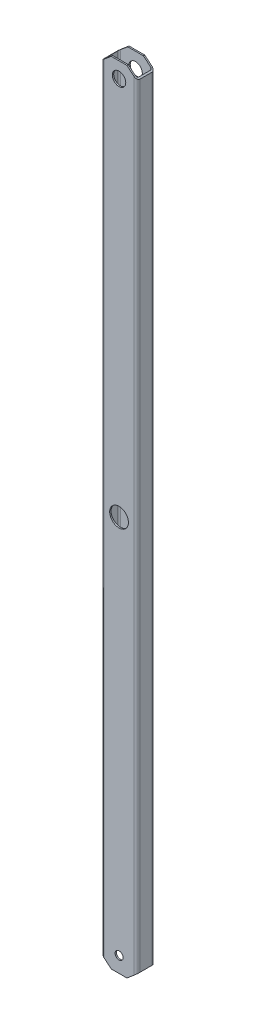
ISO-10303-21;
HEADER;
FILE_DESCRIPTION(('STEP AP214'),'2;1');
FILE_NAME('part.step','',(''),(''),'','','');
FILE_SCHEMA(('AUTOMOTIVE_DESIGN { 1 0 10303 214 1 1 1 1 }'));
ENDSEC;
DATA;
#1=APPLICATION_CONTEXT('core data for automotive mechanical design processes');
#2=APPLICATION_PROTOCOL_DEFINITION('international standard','automotive_design',2000,#1);
#3=PRODUCT_CONTEXT('',#1,'mechanical');
#4=PRODUCT('Part','Part','',(#3));
#5=PRODUCT_RELATED_PRODUCT_CATEGORY('part','',(#4));
#6=PRODUCT_DEFINITION_FORMATION('','',#4);
#7=PRODUCT_DEFINITION_CONTEXT('part definition',#1,'design');
#8=PRODUCT_DEFINITION('design','',#6,#7);
#9=PRODUCT_DEFINITION_SHAPE('','',#8);
#10=(LENGTH_UNIT() NAMED_UNIT(*) SI_UNIT(.MILLI.,.METRE.));
#11=(NAMED_UNIT(*) PLANE_ANGLE_UNIT() SI_UNIT($,.RADIAN.));
#12=(NAMED_UNIT(*) SI_UNIT($,.STERADIAN.) SOLID_ANGLE_UNIT());
#13=UNCERTAINTY_MEASURE_WITH_UNIT(LENGTH_MEASURE(1.E-05),#10,'distance_accuracy_value','');
#14=(GEOMETRIC_REPRESENTATION_CONTEXT(3) GLOBAL_UNCERTAINTY_ASSIGNED_CONTEXT((#13)) GLOBAL_UNIT_ASSIGNED_CONTEXT((#10,
#11,#12)) REPRESENTATION_CONTEXT('',''));
#15=CARTESIAN_POINT('',(0.,0.,0.));
#16=DIRECTION('',(0.,0.,1.));
#17=DIRECTION('',(1.,0.,0.));
#18=AXIS2_PLACEMENT_3D('',#15,#16,#17);
#19=CARTESIAN_POINT('',(33.6,-885.,-13.6000000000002));
#20=DIRECTION('',(0.,-1.,0.));
#21=DIRECTION('',(0.,0.,-1.));
#22=AXIS2_PLACEMENT_3D('',#19,#20,#21);
#23=PLANE('',#22);
#24=DIRECTION('',(0.,0.,-1.));
#25=VECTOR('',#24,1.);
#26=CARTESIAN_POINT('',(17.4999999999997,-885.,-13.6000000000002));
#27=LINE('',#26,#25);
#28=CARTESIAN_POINT('',(17.4999999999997,-885.,20.0000000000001));
#29=VERTEX_POINT('',#28);
#30=CARTESIAN_POINT('',(17.4999999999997,-885.,16.9999999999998));
#31=VERTEX_POINT('',#30);
#32=EDGE_CURVE('E12',#29,#31,#27,.T.);
#33=ORIENTED_EDGE('',*,*,#32,.F.);
#34=DIRECTION('',(-1.,0.,0.));
#35=VECTOR('',#34,1.);
#36=CARTESIAN_POINT('',(-33.6,-885.,19.9999999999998));
#37=LINE('',#36,#35);
#38=CARTESIAN_POINT('',(-17.5000000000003,-885.,20.0000000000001));
#39=VERTEX_POINT('',#38);
#40=EDGE_CURVE('E235',#29,#39,#37,.T.);
#41=ORIENTED_EDGE('',*,*,#40,.T.);
#42=DIRECTION('',(0.,0.,1.));
#43=VECTOR('',#42,1.);
#44=CARTESIAN_POINT('',(-17.5000000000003,-885.,-13.6000000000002));
#45=LINE('',#44,#43);
#46=CARTESIAN_POINT('',(-17.5000000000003,-885.,16.9999999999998));
#47=VERTEX_POINT('',#46);
#48=EDGE_CURVE('E71',#47,#39,#45,.T.);
#49=ORIENTED_EDGE('',*,*,#48,.F.);
#50=DIRECTION('',(-1.,0.,0.));
#51=VECTOR('',#50,1.);
#52=CARTESIAN_POINT('',(-33.6,-885.,16.9999999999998));
#53=LINE('',#52,#51);
#54=EDGE_CURVE('E244',#31,#47,#53,.T.);
#55=ORIENTED_EDGE('',*,*,#54,.F.);
#56=EDGE_LOOP('',(#33,#41,#49,#55));
#57=FACE_BOUND('',#56,.T.);
#58=ADVANCED_FACE('F63',(#57),#23,.T.);
#59=CARTESIAN_POINT('',(33.6,885.,-13.5999999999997));
#60=DIRECTION('',(0.,-1.,0.));
#61=DIRECTION('',(0.,0.,-1.));
#62=AXIS2_PLACEMENT_3D('',#59,#60,#61);
#63=PLANE('',#62);
#64=DIRECTION('',(-1.,0.,0.));
#65=VECTOR('',#64,1.);
#66=CARTESIAN_POINT('',(-33.6,885.,20.0000000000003));
#67=LINE('',#66,#65);
#68=CARTESIAN_POINT('',(17.5,885.,20.0000000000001));
#69=VERTEX_POINT('',#68);
#70=CARTESIAN_POINT('',(-17.5,885.,20.0000000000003));
#71=VERTEX_POINT('',#70);
#72=EDGE_CURVE('E260',#69,#71,#67,.T.);
#73=ORIENTED_EDGE('',*,*,#72,.F.);
#74=DIRECTION('',(0.,0.,-1.));
#75=VECTOR('',#74,1.);
#76=CARTESIAN_POINT('',(17.5,885.,-13.5999999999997));
#77=LINE('',#76,#75);
#78=CARTESIAN_POINT('',(17.5,885.,17.0000000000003));
#79=VERTEX_POINT('',#78);
#80=EDGE_CURVE('E228',#69,#79,#77,.T.);
#81=ORIENTED_EDGE('',*,*,#80,.T.);
#82=DIRECTION('',(-1.,0.,0.));
#83=VECTOR('',#82,1.);
#84=CARTESIAN_POINT('',(-33.6,885.,17.0000000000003));
#85=LINE('',#84,#83);
#86=CARTESIAN_POINT('',(-17.5,885.,17.0000000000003));
#87=VERTEX_POINT('',#86);
#88=EDGE_CURVE('E256',#79,#87,#85,.T.);
#89=ORIENTED_EDGE('',*,*,#88,.T.);
#90=DIRECTION('',(0.,0.,1.));
#91=VECTOR('',#90,1.);
#92=CARTESIAN_POINT('',(-17.5,885.,-13.5999999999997));
#93=LINE('',#92,#91);
#94=EDGE_CURVE('E288',#87,#71,#93,.T.);
#95=ORIENTED_EDGE('',*,*,#94,.T.);
#96=EDGE_LOOP('',(#73,#81,#89,#95));
#97=FACE_BOUND('',#96,.T.);
#98=ADVANCED_FACE('F317',(#97),#63,.F.);
#99=CARTESIAN_POINT('',(33.6,-885.,-13.6000000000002));
#100=DIRECTION('',(0.,1.,0.));
#101=DIRECTION('',(0.,0.,1.));
#102=AXIS2_PLACEMENT_3D('',#99,#100,#101);
#103=CYLINDRICAL_SURFACE('',#102,6.40000000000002);
#104=DIRECTION('',(0.,1.,0.));
#105=VECTOR('',#104,1.);
#106=CARTESIAN_POINT('',(33.6,-885.,-20.0000000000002));
#107=LINE('',#106,#105);
#108=CARTESIAN_POINT('',(33.6,-871.490495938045,-20.0000000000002));
#109=VERTEX_POINT('',#108);
#110=CARTESIAN_POINT('',(33.5999999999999,871.490495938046,-19.9999999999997));
#111=VERTEX_POINT('',#110);
#112=EDGE_CURVE('E266',#109,#111,#107,.T.);
#113=ORIENTED_EDGE('',*,*,#112,.T.);
#114=CARTESIAN_POINT('',(33.6,871.490495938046,-13.5999999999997));
#115=DIRECTION('',(-0.642787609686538,-0.766044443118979,0.));
#116=DIRECTION('',(-0.766044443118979,0.642787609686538,0.));
#117=AXIS2_PLACEMENT_3D('',#114,#115,#116);
#118=ELLIPSE('',#117,8.35460665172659,6.40000000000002);
#119=CARTESIAN_POINT('',(40.,866.120258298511,-13.6000000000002));
#120=VERTEX_POINT('',#119);
#121=EDGE_CURVE('E363',#111,#120,#118,.T.);
#122=ORIENTED_EDGE('',*,*,#121,.T.);
#123=DIRECTION('',(0.,1.,0.));
#124=VECTOR('',#123,1.);
#125=CARTESIAN_POINT('',(40.,-885.,-13.6000000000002));
#126=LINE('',#125,#124);
#127=CARTESIAN_POINT('',(39.9999999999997,-866.120258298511,-13.6000000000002));
#128=VERTEX_POINT('',#127);
#129=EDGE_CURVE('E285',#128,#120,#126,.T.);
#130=ORIENTED_EDGE('',*,*,#129,.F.);
#131=CARTESIAN_POINT('',(33.6,-871.490495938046,-13.6000000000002));
#132=DIRECTION('',(-0.642787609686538,0.766044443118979,0.));
#133=DIRECTION('',(0.766044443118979,0.642787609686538,0.));
#134=AXIS2_PLACEMENT_3D('',#131,#132,#133);
#135=ELLIPSE('',#134,8.35460665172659,6.40000000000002);
#136=EDGE_CURVE('E392',#128,#109,#135,.T.);
#137=ORIENTED_EDGE('',*,*,#136,.T.);
#138=EDGE_LOOP('',(#113,#122,#130,#137));
#139=FACE_BOUND('',#138,.T.);
#140=ADVANCED_FACE('F531',(#139),#103,.T.);
#141=CARTESIAN_POINT('',(40.,-885.,-13.6000000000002));
#142=DIRECTION('',(-1.,0.,0.));
#143=DIRECTION('',(0.,0.,1.));
#144=AXIS2_PLACEMENT_3D('',#141,#142,#143);
#145=PLANE('',#144);
#146=ORIENTED_EDGE('',*,*,#129,.T.);
#147=DIRECTION('',(0.,0.,1.));
#148=VECTOR('',#147,1.);
#149=CARTESIAN_POINT('',(40.,866.120258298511,-79.3969696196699));
#150=LINE('',#149,#148);
#151=CARTESIAN_POINT('',(40.,866.120258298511,13.6000000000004));
#152=VERTEX_POINT('',#151);
#153=EDGE_CURVE('E470',#120,#152,#150,.T.);
#154=ORIENTED_EDGE('',*,*,#153,.T.);
#155=DIRECTION('',(0.,1.,0.));
#156=VECTOR('',#155,1.);
#157=CARTESIAN_POINT('',(40.,-885.,13.5999999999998));
#158=LINE('',#157,#156);
#159=CARTESIAN_POINT('',(40.,-866.120258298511,13.5999999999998));
#160=VERTEX_POINT('',#159);
#161=EDGE_CURVE('E282',#160,#152,#158,.T.);
#162=ORIENTED_EDGE('',*,*,#161,.F.);
#163=DIRECTION('',(0.,0.,1.));
#164=VECTOR('',#163,1.);
#165=CARTESIAN_POINT('',(39.9999999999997,-866.120258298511,-79.3969696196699));
#166=LINE('',#165,#164);
#167=EDGE_CURVE('E428',#128,#160,#166,.T.);
#168=ORIENTED_EDGE('',*,*,#167,.F.);
#169=EDGE_LOOP('',(#146,#154,#162,#168));
#170=FACE_BOUND('',#169,.T.);
#171=ADVANCED_FACE('F775',(#170),#145,.F.);
#172=CARTESIAN_POINT('',(33.6,-885.,13.5999999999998));
#173=DIRECTION('',(0.,1.,0.));
#174=DIRECTION('',(0.,0.,1.));
#175=AXIS2_PLACEMENT_3D('',#172,#173,#174);
#176=CYLINDRICAL_SURFACE('',#175,6.40000000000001);
#177=ORIENTED_EDGE('',*,*,#161,.T.);
#178=CARTESIAN_POINT('',(33.6,871.490495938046,13.6000000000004));
#179=DIRECTION('',(-0.642787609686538,-0.766044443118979,0.));
#180=DIRECTION('',(-0.766044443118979,0.642787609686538,0.));
#181=AXIS2_PLACEMENT_3D('',#178,#179,#180);
#182=ELLIPSE('',#181,8.35460665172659,6.40000000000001);
#183=CARTESIAN_POINT('',(33.5999999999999,871.490495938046,20.0000000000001));
#184=VERTEX_POINT('',#183);
#185=EDGE_CURVE('E360',#152,#184,#182,.T.);
#186=ORIENTED_EDGE('',*,*,#185,.T.);
#187=DIRECTION('',(0.,1.,0.));
#188=VECTOR('',#187,1.);
#189=CARTESIAN_POINT('',(33.6,-885.,19.9999999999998));
#190=LINE('',#189,#188);
#191=CARTESIAN_POINT('',(33.6,-871.490495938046,20.0000000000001));
#192=VERTEX_POINT('',#191);
#193=EDGE_CURVE('E280',#192,#184,#190,.T.);
#194=ORIENTED_EDGE('',*,*,#193,.F.);
#195=CARTESIAN_POINT('',(33.6,-871.490495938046,13.5999999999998));
#196=DIRECTION('',(-0.642787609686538,0.766044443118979,0.));
#197=DIRECTION('',(0.766044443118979,0.642787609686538,0.));
#198=AXIS2_PLACEMENT_3D('',#195,#196,#197);
#199=ELLIPSE('',#198,8.35460665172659,6.40000000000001);
#200=EDGE_CURVE('E389',#192,#160,#199,.T.);
#201=ORIENTED_EDGE('',*,*,#200,.T.);
#202=EDGE_LOOP('',(#177,#186,#194,#201));
#203=FACE_BOUND('',#202,.T.);
#204=ADVANCED_FACE('F764',(#203),#176,.T.);
#205=CARTESIAN_POINT('',(-33.6,-885.,19.9999999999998));
#206=DIRECTION('',(0.,0.,-1.));
#207=DIRECTION('',(-1.,0.,0.));
#208=AXIS2_PLACEMENT_3D('',#205,#206,#207);
#209=PLANE('',#208);
#210=CARTESIAN_POINT('',(0.,850.,20.0000000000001));
#211=DIRECTION('',(0.,0.,1.));
#212=DIRECTION('',(1.,0.,0.));
#213=AXIS2_PLACEMENT_3D('',#210,#211,#212);
#214=CIRCLE('',#213,15.);
#215=CARTESIAN_POINT('',(15.,850.,20.0000000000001));
#216=VERTEX_POINT('',#215);
#217=EDGE_CURVE('E460',#216,#216,#214,.T.);
#218=ORIENTED_EDGE('',*,*,#217,.F.);
#219=EDGE_LOOP('',(#218));
#220=FACE_BOUND('',#219,.T.);
#221=CARTESIAN_POINT('',(0.,-850.,20.0000000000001));
#222=DIRECTION('',(0.,0.,1.));
#223=DIRECTION('',(1.,0.,0.));
#224=AXIS2_PLACEMENT_3D('',#221,#222,#223);
#225=CIRCLE('',#224,9.);
#226=CARTESIAN_POINT('',(9.,-850.,20.0000000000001));
#227=VERTEX_POINT('',#226);
#228=EDGE_CURVE('E430',#227,#227,#225,.T.);
#229=ORIENTED_EDGE('',*,*,#228,.F.);
#230=EDGE_LOOP('',(#229));
#231=FACE_BOUND('',#230,.T.);
#232=CARTESIAN_POINT('',(0.,0.,20.0000000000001));
#233=DIRECTION('',(0.,0.,1.));
#234=DIRECTION('',(1.,0.,0.));
#235=AXIS2_PLACEMENT_3D('',#232,#233,#234);
#236=CIRCLE('',#235,21.);
#237=CARTESIAN_POINT('',(21.,0.,20.0000000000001));
#238=VERTEX_POINT('',#237);
#239=EDGE_CURVE('E455',#238,#238,#236,.T.);
#240=ORIENTED_EDGE('',*,*,#239,.F.);
#241=EDGE_LOOP('',(#240));
#242=FACE_BOUND('',#241,.T.);
#243=ORIENTED_EDGE('',*,*,#193,.T.);
#244=DIRECTION('',(0.766044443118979,-0.642787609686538,0.));
#245=VECTOR('',#244,1.);
#246=CARTESIAN_POINT('',(40.,866.120258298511,20.0000000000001));
#247=LINE('',#246,#245);
#248=EDGE_CURVE('E468',#69,#184,#247,.T.);
#249=ORIENTED_EDGE('',*,*,#248,.F.);
#250=ORIENTED_EDGE('',*,*,#72,.T.);
#251=DIRECTION('',(0.766044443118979,0.642787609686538,0.));
#252=VECTOR('',#251,1.);
#253=CARTESIAN_POINT('',(-40.,866.120258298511,20.0000000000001));
#254=LINE('',#253,#252);
#255=CARTESIAN_POINT('',(-33.6,871.490495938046,20.0000000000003));
#256=VERTEX_POINT('',#255);
#257=EDGE_CURVE('E437',#256,#71,#254,.T.);
#258=ORIENTED_EDGE('',*,*,#257,.F.);
#259=DIRECTION('',(0.,1.,0.));
#260=VECTOR('',#259,1.);
#261=CARTESIAN_POINT('',(-33.6,-885.,19.9999999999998));
#262=LINE('',#261,#260);
#263=CARTESIAN_POINT('',(-33.6,-871.490495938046,20.));
#264=VERTEX_POINT('',#263);
#265=EDGE_CURVE('E238',#264,#256,#262,.T.);
#266=ORIENTED_EDGE('',*,*,#265,.F.);
#267=DIRECTION('',(-0.766044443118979,0.642787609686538,0.));
#268=VECTOR('',#267,1.);
#269=CARTESIAN_POINT('',(-40.0000000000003,-866.120258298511,20.0000000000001));
#270=LINE('',#269,#268);
#271=EDGE_CURVE('E222',#39,#264,#270,.T.);
#272=ORIENTED_EDGE('',*,*,#271,.F.);
#273=ORIENTED_EDGE('',*,*,#40,.F.);
#274=DIRECTION('',(-0.766044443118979,-0.642787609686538,0.));
#275=VECTOR('',#274,1.);
#276=CARTESIAN_POINT('',(39.9999999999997,-866.120258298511,20.0000000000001));
#277=LINE('',#276,#275);
#278=EDGE_CURVE('E432',#192,#29,#277,.T.);
#279=ORIENTED_EDGE('',*,*,#278,.F.);
#280=EDGE_LOOP('',(#243,#249,#250,#258,#266,#272,#273,#279));
#281=FACE_BOUND('',#280,.T.);
#282=ADVANCED_FACE('F233',(#220,#231,#242,#281),#209,.F.);
#283=CARTESIAN_POINT('',(-33.6,-885.,13.5999999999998));
#284=DIRECTION('',(0.,1.,0.));
#285=DIRECTION('',(0.,0.,1.));
#286=AXIS2_PLACEMENT_3D('',#283,#284,#285);
#287=CYLINDRICAL_SURFACE('',#286,6.40000000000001);
#288=DIRECTION('',(0.,1.,0.));
#289=VECTOR('',#288,1.);
#290=CARTESIAN_POINT('',(-40.,-885.,13.5999999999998));
#291=LINE('',#290,#289);
#292=CARTESIAN_POINT('',(-40.0000000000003,-866.120258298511,13.6000000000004));
#293=VERTEX_POINT('',#292);
#294=CARTESIAN_POINT('',(-40.,866.120258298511,13.6000000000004));
#295=VERTEX_POINT('',#294);
#296=EDGE_CURVE('E276',#293,#295,#291,.T.);
#297=ORIENTED_EDGE('',*,*,#296,.F.);
#298=CARTESIAN_POINT('',(-33.6,-871.490495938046,13.5999999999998));
#299=DIRECTION('',(0.642787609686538,0.766044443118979,0.));
#300=DIRECTION('',(-0.766044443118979,0.642787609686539,0.));
#301=AXIS2_PLACEMENT_3D('',#298,#299,#300);
#302=ELLIPSE('',#301,8.35460665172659,6.40000000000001);
#303=EDGE_CURVE('E378',#293,#264,#302,.T.);
#304=ORIENTED_EDGE('',*,*,#303,.T.);
#305=ORIENTED_EDGE('',*,*,#265,.T.);
#306=CARTESIAN_POINT('',(-33.6,871.490495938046,13.6000000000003));
#307=DIRECTION('',(0.642787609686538,-0.766044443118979,0.));
#308=DIRECTION('',(0.766044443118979,0.642787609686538,0.));
#309=AXIS2_PLACEMENT_3D('',#306,#307,#308);
#310=ELLIPSE('',#309,8.35460665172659,6.40000000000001);
#311=EDGE_CURVE('E348',#256,#295,#310,.T.);
#312=ORIENTED_EDGE('',*,*,#311,.T.);
#313=EDGE_LOOP('',(#297,#304,#305,#312));
#314=FACE_BOUND('',#313,.T.);
#315=ADVANCED_FACE('F448',(#314),#287,.T.);
#316=CARTESIAN_POINT('',(-40.,-885.,13.5999999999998));
#317=DIRECTION('',(1.,0.,0.));
#318=DIRECTION('',(0.,0.,-1.));
#319=AXIS2_PLACEMENT_3D('',#316,#317,#318);
#320=PLANE('',#319);
#321=DIRECTION('',(0.,1.,0.));
#322=VECTOR('',#321,1.);
#323=CARTESIAN_POINT('',(-40.,-885.,-13.6000000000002));
#324=LINE('',#323,#322);
#325=CARTESIAN_POINT('',(-40.0000000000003,-866.120258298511,-13.6000000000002));
#326=VERTEX_POINT('',#325);
#327=CARTESIAN_POINT('',(-40.,866.120258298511,-13.5999999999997));
#328=VERTEX_POINT('',#327);
#329=EDGE_CURVE('E273',#326,#328,#324,.T.);
#330=ORIENTED_EDGE('',*,*,#329,.F.);
#331=DIRECTION('',(0.,0.,1.));
#332=VECTOR('',#331,1.);
#333=CARTESIAN_POINT('',(-40.0000000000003,-866.120258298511,-79.3969696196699));
#334=LINE('',#333,#332);
#335=EDGE_CURVE('E239',#326,#293,#334,.T.);
#336=ORIENTED_EDGE('',*,*,#335,.T.);
#337=ORIENTED_EDGE('',*,*,#296,.T.);
#338=DIRECTION('',(0.,0.,1.));
#339=VECTOR('',#338,1.);
#340=CARTESIAN_POINT('',(-40.,866.120258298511,-79.3969696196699));
#341=LINE('',#340,#339);
#342=EDGE_CURVE('E439',#328,#295,#341,.T.);
#343=ORIENTED_EDGE('',*,*,#342,.F.);
#344=EDGE_LOOP('',(#330,#336,#337,#343));
#345=FACE_BOUND('',#344,.T.);
#346=ADVANCED_FACE('F450',(#345),#320,.F.);
#347=CARTESIAN_POINT('',(-33.6,-885.,-13.6000000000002));
#348=DIRECTION('',(0.,1.,0.));
#349=DIRECTION('',(0.,0.,1.));
#350=AXIS2_PLACEMENT_3D('',#347,#348,#349);
#351=CYLINDRICAL_SURFACE('',#350,6.40000000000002);
#352=DIRECTION('',(0.,1.,0.));
#353=VECTOR('',#352,1.);
#354=CARTESIAN_POINT('',(-33.6,-885.,-20.0000000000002));
#355=LINE('',#354,#353);
#356=CARTESIAN_POINT('',(-33.6,-871.490495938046,-20.0000000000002));
#357=VERTEX_POINT('',#356);
#358=CARTESIAN_POINT('',(-33.5999999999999,871.490495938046,-19.9999999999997));
#359=VERTEX_POINT('',#358);
#360=EDGE_CURVE('E269',#357,#359,#355,.T.);
#361=ORIENTED_EDGE('',*,*,#360,.F.);
#362=CARTESIAN_POINT('',(-33.6,-871.490495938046,-13.6000000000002));
#363=DIRECTION('',(0.642787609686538,0.766044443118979,0.));
#364=DIRECTION('',(-0.766044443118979,0.642787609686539,0.));
#365=AXIS2_PLACEMENT_3D('',#362,#363,#364);
#366=ELLIPSE('',#365,8.3546066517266,6.40000000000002);
#367=EDGE_CURVE('E375',#357,#326,#366,.T.);
#368=ORIENTED_EDGE('',*,*,#367,.T.);
#369=ORIENTED_EDGE('',*,*,#329,.T.);
#370=CARTESIAN_POINT('',(-33.6,871.490495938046,-13.5999999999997));
#371=DIRECTION('',(0.642787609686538,-0.766044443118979,0.));
#372=DIRECTION('',(0.766044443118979,0.642787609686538,0.));
#373=AXIS2_PLACEMENT_3D('',#370,#371,#372);
#374=ELLIPSE('',#373,8.35460665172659,6.40000000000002);
#375=EDGE_CURVE('E345',#328,#359,#374,.T.);
#376=ORIENTED_EDGE('',*,*,#375,.T.);
#377=EDGE_LOOP('',(#361,#368,#369,#376));
#378=FACE_BOUND('',#377,.T.);
#379=ADVANCED_FACE('F518',(#378),#351,.T.);
#380=CARTESIAN_POINT('',(33.6,-885.,13.5999999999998));
#381=DIRECTION('',(0.,1.,0.));
#382=DIRECTION('',(0.,0.,1.));
#383=AXIS2_PLACEMENT_3D('',#380,#381,#382);
#384=CYLINDRICAL_SURFACE('',#383,3.4);
#385=CARTESIAN_POINT('',(33.6,871.490495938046,13.6000000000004));
#386=DIRECTION('',(-0.642787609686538,-0.766044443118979,0.));
#387=DIRECTION('',(-0.766044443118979,0.642787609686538,0.));
#388=AXIS2_PLACEMENT_3D('',#385,#386,#387);
#389=ELLIPSE('',#388,4.43838478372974,3.4);
#390=CARTESIAN_POINT('',(37.,868.637557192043,13.6000000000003));
#391=VERTEX_POINT('',#390);
#392=CARTESIAN_POINT('',(33.6,871.490495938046,17.0000000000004));
#393=VERTEX_POINT('',#392);
#394=EDGE_CURVE('E352',#391,#393,#389,.T.);
#395=ORIENTED_EDGE('',*,*,#394,.F.);
#396=DIRECTION('',(0.,1.,0.));
#397=VECTOR('',#396,1.);
#398=CARTESIAN_POINT('',(37.,-885.,13.5999999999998));
#399=LINE('',#398,#397);
#400=CARTESIAN_POINT('',(37.,-868.637557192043,13.5999999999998));
#401=VERTEX_POINT('',#400);
#402=EDGE_CURVE('E270',#401,#391,#399,.T.);
#403=ORIENTED_EDGE('',*,*,#402,.F.);
#404=CARTESIAN_POINT('',(33.6,-871.490495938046,13.5999999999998));
#405=DIRECTION('',(-0.642787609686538,0.766044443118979,0.));
#406=DIRECTION('',(0.766044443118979,0.642787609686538,0.));
#407=AXIS2_PLACEMENT_3D('',#404,#405,#406);
#408=ELLIPSE('',#407,4.43838478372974,3.4);
#409=CARTESIAN_POINT('',(33.6,-871.490495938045,16.9999999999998));
#410=VERTEX_POINT('',#409);
#411=EDGE_CURVE('E382',#410,#401,#408,.T.);
#412=ORIENTED_EDGE('',*,*,#411,.F.);
#413=DIRECTION('',(0.,1.,0.));
#414=VECTOR('',#413,1.);
#415=CARTESIAN_POINT('',(33.6,-885.,16.9999999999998));
#416=LINE('',#415,#414);
#417=EDGE_CURVE('E247',#410,#393,#416,.T.);
#418=ORIENTED_EDGE('',*,*,#417,.T.);
#419=EDGE_LOOP('',(#395,#403,#412,#418));
#420=FACE_BOUND('',#419,.T.);
#421=ADVANCED_FACE('F65',(#420),#384,.F.);
#422=CARTESIAN_POINT('',(37.,-885.,-13.6000000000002));
#423=DIRECTION('',(-1.,0.,0.));
#424=DIRECTION('',(0.,0.,1.));
#425=AXIS2_PLACEMENT_3D('',#422,#423,#424);
#426=PLANE('',#425);
#427=DIRECTION('',(0.,0.,1.));
#428=VECTOR('',#427,1.);
#429=CARTESIAN_POINT('',(37.,868.637557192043,-13.6000000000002));
#430=LINE('',#429,#428);
#431=CARTESIAN_POINT('',(37.,868.637557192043,-13.6000000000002));
#432=VERTEX_POINT('',#431);
#433=EDGE_CURVE('E354',#432,#391,#430,.T.);
#434=ORIENTED_EDGE('',*,*,#433,.F.);
#435=DIRECTION('',(0.,1.,0.));
#436=VECTOR('',#435,1.);
#437=CARTESIAN_POINT('',(37.,-885.,-13.6000000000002));
#438=LINE('',#437,#436);
#439=CARTESIAN_POINT('',(37.,-868.637557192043,-13.6000000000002));
#440=VERTEX_POINT('',#439);
#441=EDGE_CURVE('E306',#440,#432,#438,.T.);
#442=ORIENTED_EDGE('',*,*,#441,.F.);
#443=DIRECTION('',(0.,0.,-1.));
#444=VECTOR('',#443,1.);
#445=CARTESIAN_POINT('',(37.,-868.637557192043,-13.6000000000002));
#446=LINE('',#445,#444);
#447=EDGE_CURVE('E384',#401,#440,#446,.T.);
#448=ORIENTED_EDGE('',*,*,#447,.F.);
#449=ORIENTED_EDGE('',*,*,#402,.T.);
#450=EDGE_LOOP('',(#434,#442,#448,#449));
#451=FACE_BOUND('',#450,.T.);
#452=ADVANCED_FACE('F506',(#451),#426,.T.);
#453=CARTESIAN_POINT('',(33.6,-885.,-13.6000000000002));
#454=DIRECTION('',(0.,1.,0.));
#455=DIRECTION('',(0.,0.,1.));
#456=AXIS2_PLACEMENT_3D('',#453,#454,#455);
#457=CYLINDRICAL_SURFACE('',#456,3.4);
#458=CARTESIAN_POINT('',(33.6,871.490495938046,-13.5999999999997));
#459=DIRECTION('',(-0.642787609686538,-0.766044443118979,0.));
#460=DIRECTION('',(-0.766044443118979,0.642787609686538,0.));
#461=AXIS2_PLACEMENT_3D('',#458,#459,#460);
#462=ELLIPSE('',#461,4.43838478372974,3.4);
#463=CARTESIAN_POINT('',(33.6,871.490495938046,-16.9999999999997));
#464=VERTEX_POINT('',#463);
#465=EDGE_CURVE('E356',#464,#432,#462,.T.);
#466=ORIENTED_EDGE('',*,*,#465,.F.);
#467=DIRECTION('',(0.,1.,0.));
#468=VECTOR('',#467,1.);
#469=CARTESIAN_POINT('',(33.6,-885.,-17.0000000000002));
#470=LINE('',#469,#468);
#471=CARTESIAN_POINT('',(33.6,-871.490495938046,-17.0000000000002));
#472=VERTEX_POINT('',#471);
#473=EDGE_CURVE('E303',#472,#464,#470,.T.);
#474=ORIENTED_EDGE('',*,*,#473,.F.);
#475=CARTESIAN_POINT('',(33.6,-871.490495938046,-13.6000000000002));
#476=DIRECTION('',(-0.642787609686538,0.766044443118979,0.));
#477=DIRECTION('',(0.766044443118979,0.642787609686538,0.));
#478=AXIS2_PLACEMENT_3D('',#475,#476,#477);
#479=ELLIPSE('',#478,4.43838478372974,3.4);
#480=EDGE_CURVE('E386',#440,#472,#479,.T.);
#481=ORIENTED_EDGE('',*,*,#480,.F.);
#482=ORIENTED_EDGE('',*,*,#441,.T.);
#483=EDGE_LOOP('',(#466,#474,#481,#482));
#484=FACE_BOUND('',#483,.T.);
#485=ADVANCED_FACE('F501',(#484),#457,.F.);
#486=CARTESIAN_POINT('',(33.6,-885.,-17.0000000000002));
#487=DIRECTION('',(0.,0.,1.));
#488=DIRECTION('',(0.,-1.,0.));
#489=AXIS2_PLACEMENT_3D('',#486,#487,#488);
#490=PLANE('',#489);
#491=CARTESIAN_POINT('',(0.,850.,-16.9999999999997));
#492=DIRECTION('',(0.,0.,1.));
#493=DIRECTION('',(0.,-1.,0.));
#494=AXIS2_PLACEMENT_3D('',#491,#492,#493);
#495=CIRCLE('',#494,15.);
#496=CARTESIAN_POINT('',(0.,835.,-16.9999999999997));
#497=VERTEX_POINT('',#496);
#498=EDGE_CURVE('E257',#497,#497,#495,.T.);
#499=ORIENTED_EDGE('',*,*,#498,.F.);
#500=EDGE_LOOP('',(#499));
#501=FACE_BOUND('',#500,.T.);
#502=DIRECTION('',(0.766044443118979,-0.642787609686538,0.));
#503=VECTOR('',#502,1.);
#504=CARTESIAN_POINT('',(898.502729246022,145.750934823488,-16.9999999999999));
#505=LINE('',#504,#503);
#506=CARTESIAN_POINT('',(17.5,885.,-16.9999999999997));
#507=VERTEX_POINT('',#506);
#508=EDGE_CURVE('E358',#507,#464,#505,.T.);
#509=ORIENTED_EDGE('',*,*,#508,.F.);
#510=DIRECTION('',(1.,0.,0.));
#511=VECTOR('',#510,1.);
#512=CARTESIAN_POINT('',(33.6,885.,-16.9999999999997));
#513=LINE('',#512,#511);
#514=CARTESIAN_POINT('',(-17.5,885.,-16.9999999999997));
#515=VERTEX_POINT('',#514);
#516=EDGE_CURVE('E253',#515,#507,#513,.T.);
#517=ORIENTED_EDGE('',*,*,#516,.F.);
#518=DIRECTION('',(0.766044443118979,0.642787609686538,0.));
#519=VECTOR('',#518,1.);
#520=CARTESIAN_POINT('',(-859.068150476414,178.840475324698,-16.9999999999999));
#521=LINE('',#520,#519);
#522=CARTESIAN_POINT('',(-33.6,871.490495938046,-16.9999999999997));
#523=VERTEX_POINT('',#522);
#524=EDGE_CURVE('E343',#523,#515,#521,.T.);
#525=ORIENTED_EDGE('',*,*,#524,.F.);
#526=DIRECTION('',(0.,1.,0.));
#527=VECTOR('',#526,1.);
#528=CARTESIAN_POINT('',(-33.6,-885.,-17.0000000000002));
#529=LINE('',#528,#527);
#530=CARTESIAN_POINT('',(-33.6,-871.490495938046,-17.0000000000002));
#531=VERTEX_POINT('',#530);
#532=EDGE_CURVE('E300',#531,#523,#529,.T.);
#533=ORIENTED_EDGE('',*,*,#532,.F.);
#534=DIRECTION('',(-0.766044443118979,0.642787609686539,0.));
#535=VECTOR('',#534,1.);
#536=CARTESIAN_POINT('',(12.48671093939,-910.161838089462,-17.0000000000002));
#537=LINE('',#536,#535);
#538=CARTESIAN_POINT('',(-17.5000000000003,-885.,-17.0000000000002));
#539=VERTEX_POINT('',#538);
#540=EDGE_CURVE('E373',#539,#531,#537,.T.);
#541=ORIENTED_EDGE('',*,*,#540,.F.);
#542=DIRECTION('',(1.,0.,0.));
#543=VECTOR('',#542,1.);
#544=CARTESIAN_POINT('',(33.6,-885.,-17.0000000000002));
#545=LINE('',#544,#543);
#546=CARTESIAN_POINT('',(17.4999999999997,-885.,-17.0000000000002));
#547=VERTEX_POINT('',#546);
#548=EDGE_CURVE('E249',#539,#547,#545,.T.);
#549=ORIENTED_EDGE('',*,*,#548,.T.);
#550=DIRECTION('',(-0.766044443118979,-0.642787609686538,0.));
#551=VECTOR('',#550,1.);
#552=CARTESIAN_POINT('',(26.9478678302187,-877.072297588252,-17.0000000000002));
#553=LINE('',#552,#551);
#554=EDGE_CURVE('E86',#472,#547,#553,.T.);
#555=ORIENTED_EDGE('',*,*,#554,.F.);
#556=ORIENTED_EDGE('',*,*,#473,.T.);
#557=EDGE_LOOP('',(#509,#517,#525,#533,#541,#549,#555,#556));
#558=FACE_BOUND('',#557,.T.);
#559=CARTESIAN_POINT('',(0.,-850.,-17.0000000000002));
#560=DIRECTION('',(0.,0.,1.));
#561=DIRECTION('',(0.,-1.,0.));
#562=AXIS2_PLACEMENT_3D('',#559,#560,#561);
#563=CIRCLE('',#562,9.);
#564=CARTESIAN_POINT('',(0.,-859.,-17.0000000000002));
#565=VERTEX_POINT('',#564);
#566=EDGE_CURVE('E404',#565,#565,#563,.T.);
#567=ORIENTED_EDGE('',*,*,#566,.F.);
#568=EDGE_LOOP('',(#567));
#569=FACE_BOUND('',#568,.T.);
#570=CARTESIAN_POINT('',(0.,0.,-16.9999999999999));
#571=DIRECTION('',(0.,0.,1.));
#572=DIRECTION('',(0.,-1.,0.));
#573=AXIS2_PLACEMENT_3D('',#570,#571,#572);
#574=CIRCLE('',#573,21.);
#575=CARTESIAN_POINT('',(0.,-21.,-17.));
#576=VERTEX_POINT('',#575);
#577=EDGE_CURVE('E398',#576,#576,#574,.T.);
#578=ORIENTED_EDGE('',*,*,#577,.F.);
#579=EDGE_LOOP('',(#578));
#580=FACE_BOUND('',#579,.T.);
#581=ADVANCED_FACE('F416',(#501,#558,#569,#580),#490,.T.);
#582=CARTESIAN_POINT('',(-33.6,-885.,-13.6000000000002));
#583=DIRECTION('',(0.,1.,0.));
#584=DIRECTION('',(0.,0.,1.));
#585=AXIS2_PLACEMENT_3D('',#582,#583,#584);
#586=CYLINDRICAL_SURFACE('',#585,3.4);
#587=CARTESIAN_POINT('',(-33.6,-871.490495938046,-13.6000000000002));
#588=DIRECTION('',(0.642787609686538,0.766044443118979,0.));
#589=DIRECTION('',(-0.766044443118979,0.642787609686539,0.));
#590=AXIS2_PLACEMENT_3D('',#587,#588,#589);
#591=ELLIPSE('',#590,4.43838478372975,3.4);
#592=CARTESIAN_POINT('',(-37.,-868.637557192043,-13.6000000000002));
#593=VERTEX_POINT('',#592);
#594=EDGE_CURVE('E371',#531,#593,#591,.T.);
#595=ORIENTED_EDGE('',*,*,#594,.F.);
#596=ORIENTED_EDGE('',*,*,#532,.T.);
#597=CARTESIAN_POINT('',(-33.6,871.490495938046,-13.5999999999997));
#598=DIRECTION('',(0.642787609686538,-0.766044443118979,0.));
#599=DIRECTION('',(0.766044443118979,0.642787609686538,0.));
#600=AXIS2_PLACEMENT_3D('',#597,#598,#599);
#601=ELLIPSE('',#600,4.43838478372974,3.4);
#602=CARTESIAN_POINT('',(-37.,868.637557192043,-13.6000000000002));
#603=VERTEX_POINT('',#602);
#604=EDGE_CURVE('E341',#603,#523,#601,.T.);
#605=ORIENTED_EDGE('',*,*,#604,.F.);
#606=DIRECTION('',(0.,1.,0.));
#607=VECTOR('',#606,1.);
#608=CARTESIAN_POINT('',(-37.,-885.,-13.6000000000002));
#609=LINE('',#608,#607);
#610=EDGE_CURVE('E297',#593,#603,#609,.T.);
#611=ORIENTED_EDGE('',*,*,#610,.F.);
#612=EDGE_LOOP('',(#595,#596,#605,#611));
#613=FACE_BOUND('',#612,.T.);
#614=ADVANCED_FACE('F689',(#613),#586,.F.);
#615=CARTESIAN_POINT('',(-37.,-885.,13.5999999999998));
#616=DIRECTION('',(1.,0.,0.));
#617=DIRECTION('',(0.,0.,-1.));
#618=AXIS2_PLACEMENT_3D('',#615,#616,#617);
#619=PLANE('',#618);
#620=DIRECTION('',(0.,0.,1.));
#621=VECTOR('',#620,1.);
#622=CARTESIAN_POINT('',(-37.,-868.637557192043,13.5999999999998));
#623=LINE('',#622,#621);
#624=CARTESIAN_POINT('',(-37.,-868.637557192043,13.5999999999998));
#625=VERTEX_POINT('',#624);
#626=EDGE_CURVE('E369',#593,#625,#623,.T.);
#627=ORIENTED_EDGE('',*,*,#626,.F.);
#628=ORIENTED_EDGE('',*,*,#610,.T.);
#629=DIRECTION('',(0.,0.,-1.));
#630=VECTOR('',#629,1.);
#631=CARTESIAN_POINT('',(-37.,868.637557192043,13.5999999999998));
#632=LINE('',#631,#630);
#633=CARTESIAN_POINT('',(-37.,868.637557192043,13.6000000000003));
#634=VERTEX_POINT('',#633);
#635=EDGE_CURVE('E334',#634,#603,#632,.T.);
#636=ORIENTED_EDGE('',*,*,#635,.F.);
#637=DIRECTION('',(0.,1.,0.));
#638=VECTOR('',#637,1.);
#639=CARTESIAN_POINT('',(-37.,-885.,13.5999999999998));
#640=LINE('',#639,#638);
#641=EDGE_CURVE('E294',#625,#634,#640,.T.);
#642=ORIENTED_EDGE('',*,*,#641,.F.);
#643=EDGE_LOOP('',(#627,#628,#636,#642));
#644=FACE_BOUND('',#643,.T.);
#645=ADVANCED_FACE('F678',(#644),#619,.T.);
#646=CARTESIAN_POINT('',(-33.6,-885.,13.5999999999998));
#647=DIRECTION('',(0.,1.,0.));
#648=DIRECTION('',(0.,0.,1.));
#649=AXIS2_PLACEMENT_3D('',#646,#647,#648);
#650=CYLINDRICAL_SURFACE('',#649,3.4);
#651=CARTESIAN_POINT('',(-33.6,-871.490495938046,13.5999999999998));
#652=DIRECTION('',(0.642787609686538,0.766044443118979,0.));
#653=DIRECTION('',(-0.766044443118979,0.642787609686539,0.));
#654=AXIS2_PLACEMENT_3D('',#651,#652,#653);
#655=ELLIPSE('',#654,4.43838478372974,3.4);
#656=CARTESIAN_POINT('',(-33.6,-871.490495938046,16.9999999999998));
#657=VERTEX_POINT('',#656);
#658=EDGE_CURVE('E367',#625,#657,#655,.T.);
#659=ORIENTED_EDGE('',*,*,#658,.F.);
#660=ORIENTED_EDGE('',*,*,#641,.T.);
#661=CARTESIAN_POINT('',(-33.6,871.490495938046,13.6000000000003));
#662=DIRECTION('',(0.642787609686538,-0.766044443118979,0.));
#663=DIRECTION('',(0.766044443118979,0.642787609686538,0.));
#664=AXIS2_PLACEMENT_3D('',#661,#662,#663);
#665=ELLIPSE('',#664,4.43838478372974,3.4);
#666=CARTESIAN_POINT('',(-33.6,871.490495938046,17.0000000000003));
#667=VERTEX_POINT('',#666);
#668=EDGE_CURVE('E331',#667,#634,#665,.T.);
#669=ORIENTED_EDGE('',*,*,#668,.F.);
#670=DIRECTION('',(0.,1.,0.));
#671=VECTOR('',#670,1.);
#672=CARTESIAN_POINT('',(-33.6,-885.,16.9999999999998));
#673=LINE('',#672,#671);
#674=EDGE_CURVE('E291',#657,#667,#673,.T.);
#675=ORIENTED_EDGE('',*,*,#674,.F.);
#676=EDGE_LOOP('',(#659,#660,#669,#675));
#677=FACE_BOUND('',#676,.T.);
#678=ADVANCED_FACE('F666',(#677),#650,.F.);
#679=CARTESIAN_POINT('',(-33.6,-885.,16.9999999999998));
#680=DIRECTION('',(0.,0.,-1.));
#681=DIRECTION('',(-1.,0.,0.));
#682=AXIS2_PLACEMENT_3D('',#679,#680,#681);
#683=PLANE('',#682);
#684=CARTESIAN_POINT('',(0.,850.,17.0000000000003));
#685=DIRECTION('',(0.,0.,-1.));
#686=DIRECTION('',(-1.,0.,0.));
#687=AXIS2_PLACEMENT_3D('',#684,#685,#686);
#688=CIRCLE('',#687,15.);
#689=CARTESIAN_POINT('',(-15.,850.,17.0000000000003));
#690=VERTEX_POINT('',#689);
#691=EDGE_CURVE('E407',#690,#690,#688,.T.);
#692=ORIENTED_EDGE('',*,*,#691,.F.);
#693=EDGE_LOOP('',(#692));
#694=FACE_BOUND('',#693,.T.);
#695=DIRECTION('',(-0.766044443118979,0.642787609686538,0.));
#696=VECTOR('',#695,1.);
#697=CARTESIAN_POINT('',(859.068150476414,178.840475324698,17.0000000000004));
#698=LINE('',#697,#696);
#699=EDGE_CURVE('E326',#393,#79,#698,.T.);
#700=ORIENTED_EDGE('',*,*,#699,.F.);
#701=ORIENTED_EDGE('',*,*,#417,.F.);
#702=DIRECTION('',(0.766044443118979,0.642787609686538,0.));
#703=VECTOR('',#702,1.);
#704=CARTESIAN_POINT('',(-12.4867109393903,-910.161838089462,16.9999999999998));
#705=LINE('',#704,#703);
#706=EDGE_CURVE('E380',#31,#410,#705,.T.);
#707=ORIENTED_EDGE('',*,*,#706,.F.);
#708=ORIENTED_EDGE('',*,*,#54,.T.);
#709=DIRECTION('',(0.766044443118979,-0.642787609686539,0.));
#710=VECTOR('',#709,1.);
#711=CARTESIAN_POINT('',(-26.9478678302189,-877.072297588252,16.9999999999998));
#712=LINE('',#711,#710);
#713=EDGE_CURVE('E78',#657,#47,#712,.T.);
#714=ORIENTED_EDGE('',*,*,#713,.F.);
#715=ORIENTED_EDGE('',*,*,#674,.T.);
#716=DIRECTION('',(-0.766044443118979,-0.642787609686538,0.));
#717=VECTOR('',#716,1.);
#718=CARTESIAN_POINT('',(-898.502729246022,145.750934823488,16.9999999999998));
#719=LINE('',#718,#717);
#720=EDGE_CURVE('E327',#87,#667,#719,.T.);
#721=ORIENTED_EDGE('',*,*,#720,.F.);
#722=ORIENTED_EDGE('',*,*,#88,.F.);
#723=EDGE_LOOP('',(#700,#701,#707,#708,#714,#715,#721,#722));
#724=FACE_BOUND('',#723,.T.);
#725=CARTESIAN_POINT('',(0.,-850.,16.9999999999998));
#726=DIRECTION('',(0.,0.,-1.));
#727=DIRECTION('',(-1.,0.,0.));
#728=AXIS2_PLACEMENT_3D('',#725,#726,#727);
#729=CIRCLE('',#728,9.);
#730=CARTESIAN_POINT('',(-9.,-850.,16.9999999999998));
#731=VERTEX_POINT('',#730);
#732=EDGE_CURVE('E401',#731,#731,#729,.T.);
#733=ORIENTED_EDGE('',*,*,#732,.F.);
#734=EDGE_LOOP('',(#733));
#735=FACE_BOUND('',#734,.T.);
#736=CARTESIAN_POINT('',(0.,0.,17.0000000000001));
#737=DIRECTION('',(0.,0.,-1.));
#738=DIRECTION('',(-1.,0.,0.));
#739=AXIS2_PLACEMENT_3D('',#736,#737,#738);
#740=CIRCLE('',#739,21.);
#741=CARTESIAN_POINT('',(-21.,0.,17.0000000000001));
#742=VERTEX_POINT('',#741);
#743=EDGE_CURVE('E395',#742,#742,#740,.T.);
#744=ORIENTED_EDGE('',*,*,#743,.F.);
#745=EDGE_LOOP('',(#744));
#746=FACE_BOUND('',#745,.T.);
#747=ADVANCED_FACE('F323',(#694,#724,#735,#746),#683,.T.);
#748=CARTESIAN_POINT('',(33.6,-885.,-20.0000000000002));
#749=DIRECTION('',(0.,0.,1.));
#750=DIRECTION('',(0.,-1.,0.));
#751=AXIS2_PLACEMENT_3D('',#748,#749,#750);
#752=PLANE('',#751);
#753=CARTESIAN_POINT('',(0.,850.,-19.9999999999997));
#754=DIRECTION('',(0.,0.,1.));
#755=DIRECTION('',(0.,-1.,0.));
#756=AXIS2_PLACEMENT_3D('',#753,#754,#755);
#757=CIRCLE('',#756,15.);
#758=CARTESIAN_POINT('',(0.,835.,-19.9999999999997));
#759=VERTEX_POINT('',#758);
#760=EDGE_CURVE('E440',#759,#759,#757,.F.);
#761=ORIENTED_EDGE('',*,*,#760,.F.);
#762=EDGE_LOOP('',(#761));
#763=FACE_BOUND('',#762,.T.);
#764=CARTESIAN_POINT('',(0.,-850.,-20.0000000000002));
#765=DIRECTION('',(0.,0.,1.));
#766=DIRECTION('',(0.,-1.,0.));
#767=AXIS2_PLACEMENT_3D('',#764,#765,#766);
#768=CIRCLE('',#767,9.);
#769=CARTESIAN_POINT('',(0.,-859.,-20.0000000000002));
#770=VERTEX_POINT('',#769);
#771=EDGE_CURVE('E471',#770,#770,#768,.F.);
#772=ORIENTED_EDGE('',*,*,#771,.F.);
#773=EDGE_LOOP('',(#772));
#774=FACE_BOUND('',#773,.T.);
#775=CARTESIAN_POINT('',(0.,0.,-19.9999999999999));
#776=DIRECTION('',(0.,0.,1.));
#777=DIRECTION('',(0.,-1.,0.));
#778=AXIS2_PLACEMENT_3D('',#775,#776,#777);
#779=CIRCLE('',#778,21.);
#780=CARTESIAN_POINT('',(0.,-21.,-19.9999999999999));
#781=VERTEX_POINT('',#780);
#782=EDGE_CURVE('E240',#781,#781,#779,.F.);
#783=ORIENTED_EDGE('',*,*,#782,.F.);
#784=EDGE_LOOP('',(#783));
#785=FACE_BOUND('',#784,.T.);
#786=DIRECTION('',(1.,0.,0.));
#787=VECTOR('',#786,1.);
#788=CARTESIAN_POINT('',(33.6,885.,-19.9999999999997));
#789=LINE('',#788,#787);
#790=CARTESIAN_POINT('',(-17.5,885.,-19.9999999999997));
#791=VERTEX_POINT('',#790);
#792=CARTESIAN_POINT('',(17.5,885.,-19.9999999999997));
#793=VERTEX_POINT('',#792);
#794=EDGE_CURVE('E263',#791,#793,#789,.T.);
#795=ORIENTED_EDGE('',*,*,#794,.T.);
#796=DIRECTION('',(-0.766044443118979,0.642787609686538,0.));
#797=VECTOR('',#796,1.);
#798=CARTESIAN_POINT('',(40.,866.120258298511,-19.9999999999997));
#799=LINE('',#798,#797);
#800=EDGE_CURVE('E463',#111,#793,#799,.T.);
#801=ORIENTED_EDGE('',*,*,#800,.F.);
#802=ORIENTED_EDGE('',*,*,#112,.F.);
#803=DIRECTION('',(0.766044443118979,0.642787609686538,0.));
#804=VECTOR('',#803,1.);
#805=CARTESIAN_POINT('',(39.9999999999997,-866.120258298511,-20.0000000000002));
#806=LINE('',#805,#804);
#807=CARTESIAN_POINT('',(17.4999999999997,-885.,-20.0000000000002));
#808=VERTEX_POINT('',#807);
#809=EDGE_CURVE('E427',#808,#109,#806,.T.);
#810=ORIENTED_EDGE('',*,*,#809,.F.);
#811=DIRECTION('',(1.,0.,0.));
#812=VECTOR('',#811,1.);
#813=CARTESIAN_POINT('',(33.6,-885.,-20.0000000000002));
#814=LINE('',#813,#812);
#815=CARTESIAN_POINT('',(-17.5000000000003,-885.,-20.0000000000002));
#816=VERTEX_POINT('',#815);
#817=EDGE_CURVE('E243',#816,#808,#814,.T.);
#818=ORIENTED_EDGE('',*,*,#817,.F.);
#819=DIRECTION('',(0.766044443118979,-0.642787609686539,0.));
#820=VECTOR('',#819,1.);
#821=CARTESIAN_POINT('',(-40.0000000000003,-866.120258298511,-20.0000000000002));
#822=LINE('',#821,#820);
#823=EDGE_CURVE('E452',#357,#816,#822,.T.);
#824=ORIENTED_EDGE('',*,*,#823,.F.);
#825=ORIENTED_EDGE('',*,*,#360,.T.);
#826=DIRECTION('',(-0.766044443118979,-0.642787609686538,0.));
#827=VECTOR('',#826,1.);
#828=CARTESIAN_POINT('',(-40.,866.120258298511,-19.9999999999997));
#829=LINE('',#828,#827);
#830=EDGE_CURVE('E332',#791,#359,#829,.T.);
#831=ORIENTED_EDGE('',*,*,#830,.F.);
#832=EDGE_LOOP('',(#795,#801,#802,#810,#818,#824,#825,#831));
#833=FACE_BOUND('',#832,.T.);
#834=ADVANCED_FACE('F481',(#763,#774,#785,#833),#752,.F.);
#835=DIRECTION('',(0.,0.,1.));
#836=VECTOR('',#835,1.);
#837=CARTESIAN_POINT('',(17.4999999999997,-885.,-79.3969696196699));
#838=LINE('',#837,#836);
#839=EDGE_CURVE('E425',#808,#547,#838,.T.);
#840=ORIENTED_EDGE('',*,*,#839,.T.);
#841=ORIENTED_EDGE('',*,*,#548,.F.);
#842=DIRECTION('',(0.,0.,1.));
#843=VECTOR('',#842,1.);
#844=CARTESIAN_POINT('',(-17.5000000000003,-885.,-79.3969696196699));
#845=LINE('',#844,#843);
#846=EDGE_CURVE('E423',#816,#539,#845,.T.);
#847=ORIENTED_EDGE('',*,*,#846,.F.);
#848=ORIENTED_EDGE('',*,*,#817,.T.);
#849=EDGE_LOOP('',(#840,#841,#847,#848));
#850=FACE_BOUND('',#849,.T.);
#851=ADVANCED_FACE('F422',(#850),#23,.T.);
#852=ORIENTED_EDGE('',*,*,#516,.T.);
#853=DIRECTION('',(0.,0.,1.));
#854=VECTOR('',#853,1.);
#855=CARTESIAN_POINT('',(17.5,885.,-79.3969696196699));
#856=LINE('',#855,#854);
#857=EDGE_CURVE('E467',#793,#507,#856,.T.);
#858=ORIENTED_EDGE('',*,*,#857,.F.);
#859=ORIENTED_EDGE('',*,*,#794,.F.);
#860=DIRECTION('',(0.,0.,1.));
#861=VECTOR('',#860,1.);
#862=CARTESIAN_POINT('',(-17.5,885.,-79.3969696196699));
#863=LINE('',#862,#861);
#864=EDGE_CURVE('E336',#791,#515,#863,.T.);
#865=ORIENTED_EDGE('',*,*,#864,.T.);
#866=EDGE_LOOP('',(#852,#858,#859,#865));
#867=FACE_BOUND('',#866,.T.);
#868=ADVANCED_FACE('F494',(#867),#63,.F.);
#869=CARTESIAN_POINT('',(-40.,866.120258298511,-79.3969696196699));
#870=DIRECTION('',(0.642787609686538,-0.766044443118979,0.));
#871=DIRECTION('',(0.766044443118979,0.642787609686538,0.));
#872=AXIS2_PLACEMENT_3D('',#869,#870,#871);
#873=PLANE('',#872);
#874=ORIENTED_EDGE('',*,*,#257,.T.);
#875=ORIENTED_EDGE('',*,*,#94,.F.);
#876=ORIENTED_EDGE('',*,*,#720,.T.);
#877=ORIENTED_EDGE('',*,*,#668,.T.);
#878=ORIENTED_EDGE('',*,*,#635,.T.);
#879=ORIENTED_EDGE('',*,*,#604,.T.);
#880=ORIENTED_EDGE('',*,*,#524,.T.);
#881=ORIENTED_EDGE('',*,*,#864,.F.);
#882=ORIENTED_EDGE('',*,*,#830,.T.);
#883=ORIENTED_EDGE('',*,*,#375,.F.);
#884=ORIENTED_EDGE('',*,*,#342,.T.);
#885=ORIENTED_EDGE('',*,*,#311,.F.);
#886=EDGE_LOOP('',(#874,#875,#876,#877,#878,#879,#880,#881,#882,#883,#884,#885));
#887=FACE_BOUND('',#886,.T.);
#888=ADVANCED_FACE('F443',(#887),#873,.F.);
#889=CARTESIAN_POINT('',(40.,866.120258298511,-79.3969696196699));
#890=DIRECTION('',(-0.642787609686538,-0.766044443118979,0.));
#891=DIRECTION('',(0.766044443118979,-0.642787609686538,0.));
#892=AXIS2_PLACEMENT_3D('',#889,#890,#891);
#893=PLANE('',#892);
#894=ORIENTED_EDGE('',*,*,#800,.T.);
#895=ORIENTED_EDGE('',*,*,#857,.T.);
#896=ORIENTED_EDGE('',*,*,#508,.T.);
#897=ORIENTED_EDGE('',*,*,#465,.T.);
#898=ORIENTED_EDGE('',*,*,#433,.T.);
#899=ORIENTED_EDGE('',*,*,#394,.T.);
#900=ORIENTED_EDGE('',*,*,#699,.T.);
#901=ORIENTED_EDGE('',*,*,#80,.F.);
#902=ORIENTED_EDGE('',*,*,#248,.T.);
#903=ORIENTED_EDGE('',*,*,#185,.F.);
#904=ORIENTED_EDGE('',*,*,#153,.F.);
#905=ORIENTED_EDGE('',*,*,#121,.F.);
#906=EDGE_LOOP('',(#894,#895,#896,#897,#898,#899,#900,#901,#902,#903,#904,#905));
#907=FACE_BOUND('',#906,.T.);
#908=ADVANCED_FACE('F496',(#907),#893,.F.);
#909=CARTESIAN_POINT('',(-40.0000000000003,-866.120258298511,-79.3969696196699));
#910=DIRECTION('',(0.642787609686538,0.766044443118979,0.));
#911=DIRECTION('',(-0.766044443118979,0.642787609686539,0.));
#912=AXIS2_PLACEMENT_3D('',#909,#910,#911);
#913=PLANE('',#912);
#914=ORIENTED_EDGE('',*,*,#335,.F.);
#915=ORIENTED_EDGE('',*,*,#367,.F.);
#916=ORIENTED_EDGE('',*,*,#823,.T.);
#917=ORIENTED_EDGE('',*,*,#846,.T.);
#918=ORIENTED_EDGE('',*,*,#540,.T.);
#919=ORIENTED_EDGE('',*,*,#594,.T.);
#920=ORIENTED_EDGE('',*,*,#626,.T.);
#921=ORIENTED_EDGE('',*,*,#658,.T.);
#922=ORIENTED_EDGE('',*,*,#713,.T.);
#923=ORIENTED_EDGE('',*,*,#48,.T.);
#924=ORIENTED_EDGE('',*,*,#271,.T.);
#925=ORIENTED_EDGE('',*,*,#303,.F.);
#926=EDGE_LOOP('',(#914,#915,#916,#917,#918,#919,#920,#921,#922,#923,#924,#925));
#927=FACE_BOUND('',#926,.T.);
#928=ADVANCED_FACE('F221',(#927),#913,.F.);
#929=CARTESIAN_POINT('',(39.9999999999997,-866.120258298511,-79.3969696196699));
#930=DIRECTION('',(-0.642787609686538,0.766044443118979,0.));
#931=DIRECTION('',(-0.766044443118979,-0.642787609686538,0.));
#932=AXIS2_PLACEMENT_3D('',#929,#930,#931);
#933=PLANE('',#932);
#934=ORIENTED_EDGE('',*,*,#167,.T.);
#935=ORIENTED_EDGE('',*,*,#200,.F.);
#936=ORIENTED_EDGE('',*,*,#278,.T.);
#937=ORIENTED_EDGE('',*,*,#32,.T.);
#938=ORIENTED_EDGE('',*,*,#706,.T.);
#939=ORIENTED_EDGE('',*,*,#411,.T.);
#940=ORIENTED_EDGE('',*,*,#447,.T.);
#941=ORIENTED_EDGE('',*,*,#480,.T.);
#942=ORIENTED_EDGE('',*,*,#554,.T.);
#943=ORIENTED_EDGE('',*,*,#839,.F.);
#944=ORIENTED_EDGE('',*,*,#809,.T.);
#945=ORIENTED_EDGE('',*,*,#136,.F.);
#946=EDGE_LOOP('',(#934,#935,#936,#937,#938,#939,#940,#941,#942,#943,#944,#945));
#947=FACE_BOUND('',#946,.T.);
#948=ADVANCED_FACE('F512',(#947),#933,.F.);
#949=CARTESIAN_POINT('',(0.,0.,-79.3969696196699));
#950=DIRECTION('',(0.,0.,1.));
#951=DIRECTION('',(1.,0.,0.));
#952=AXIS2_PLACEMENT_3D('',#949,#950,#951);
#953=CYLINDRICAL_SURFACE('',#952,21.);
#954=ORIENTED_EDGE('',*,*,#577,.T.);
#955=EDGE_LOOP('',(#954));
#956=FACE_BOUND('',#955,.T.);
#957=ORIENTED_EDGE('',*,*,#782,.T.);
#958=EDGE_LOOP('',(#957));
#959=FACE_BOUND('',#958,.T.);
#960=ADVANCED_FACE('F548',(#956,#959),#953,.F.);
#961=CARTESIAN_POINT('',(0.,-850.,-79.3969696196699));
#962=DIRECTION('',(0.,0.,1.));
#963=DIRECTION('',(1.,0.,0.));
#964=AXIS2_PLACEMENT_3D('',#961,#962,#963);
#965=CYLINDRICAL_SURFACE('',#964,9.);
#966=ORIENTED_EDGE('',*,*,#566,.T.);
#967=EDGE_LOOP('',(#966));
#968=FACE_BOUND('',#967,.T.);
#969=ORIENTED_EDGE('',*,*,#771,.T.);
#970=EDGE_LOOP('',(#969));
#971=FACE_BOUND('',#970,.T.);
#972=ADVANCED_FACE('F479',(#968,#971),#965,.F.);
#973=CARTESIAN_POINT('',(0.,850.,-79.3969696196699));
#974=DIRECTION('',(0.,0.,1.));
#975=DIRECTION('',(1.,0.,0.));
#976=AXIS2_PLACEMENT_3D('',#973,#974,#975);
#977=CYLINDRICAL_SURFACE('',#976,15.);
#978=ORIENTED_EDGE('',*,*,#498,.T.);
#979=EDGE_LOOP('',(#978));
#980=FACE_BOUND('',#979,.T.);
#981=ORIENTED_EDGE('',*,*,#760,.T.);
#982=EDGE_LOOP('',(#981));
#983=FACE_BOUND('',#982,.T.);
#984=ADVANCED_FACE('F558',(#980,#983),#977,.F.);
#985=ORIENTED_EDGE('',*,*,#743,.T.);
#986=EDGE_LOOP('',(#985));
#987=FACE_BOUND('',#986,.T.);
#988=ORIENTED_EDGE('',*,*,#239,.T.);
#989=EDGE_LOOP('',(#988));
#990=FACE_BOUND('',#989,.T.);
#991=ADVANCED_FACE('F552',(#987,#990),#953,.F.);
#992=ORIENTED_EDGE('',*,*,#732,.T.);
#993=EDGE_LOOP('',(#992));
#994=FACE_BOUND('',#993,.T.);
#995=ORIENTED_EDGE('',*,*,#228,.T.);
#996=EDGE_LOOP('',(#995));
#997=FACE_BOUND('',#996,.T.);
#998=ADVANCED_FACE('F549',(#994,#997),#965,.F.);
#999=ORIENTED_EDGE('',*,*,#691,.T.);
#1000=EDGE_LOOP('',(#999));
#1001=FACE_BOUND('',#1000,.T.);
#1002=ORIENTED_EDGE('',*,*,#217,.T.);
#1003=EDGE_LOOP('',(#1002));
#1004=FACE_BOUND('',#1003,.T.);
#1005=ADVANCED_FACE('F551',(#1001,#1004),#977,.F.);
#1006=CLOSED_SHELL('',(#58,#98,#140,#171,#204,#282,#315,#346,#379,#421,#452,#485,#581,#614,#645,
#678,#747,#834,#851,#868,#888,#908,#928,#948,#960,#972,#984,#991,#998,#1005));
#1007=MANIFOLD_SOLID_BREP('B2',#1006);
#1008=ADVANCED_BREP_SHAPE_REPRESENTATION('',(#18,#1007),#14);
#1009=SHAPE_DEFINITION_REPRESENTATION(#9,#1008);
ENDSEC;
END-ISO-10303-21;
